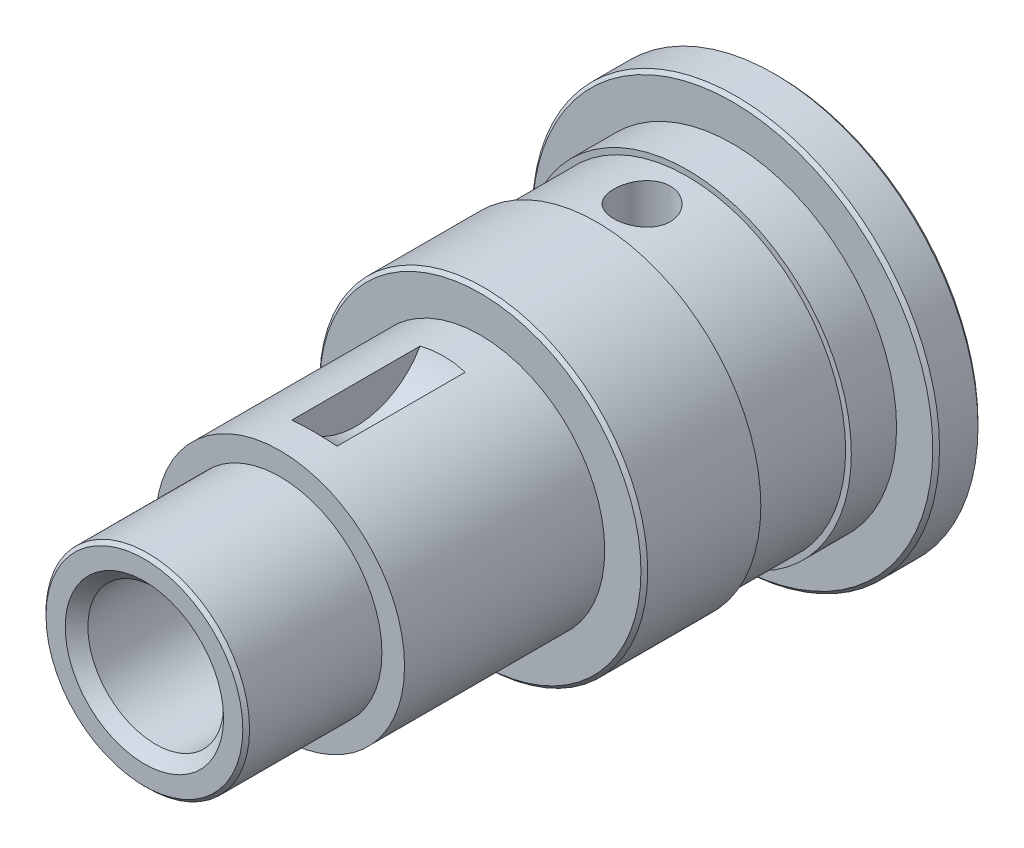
ISO-10303-21;
HEADER;
FILE_DESCRIPTION(('STEP AP214'),'2;1');
FILE_NAME('part.step','',(''),(''),'','','');
FILE_SCHEMA(('AUTOMOTIVE_DESIGN { 1 0 10303 214 1 1 1 1 }'));
ENDSEC;
DATA;
#1=APPLICATION_CONTEXT('core data for automotive mechanical design processes');
#2=APPLICATION_PROTOCOL_DEFINITION('international standard','automotive_design',2000,#1);
#3=PRODUCT_CONTEXT('',#1,'mechanical');
#4=PRODUCT('Part','Part','',(#3));
#5=PRODUCT_RELATED_PRODUCT_CATEGORY('part','',(#4));
#6=PRODUCT_DEFINITION_FORMATION('','',#4);
#7=PRODUCT_DEFINITION_CONTEXT('part definition',#1,'design');
#8=PRODUCT_DEFINITION('design','',#6,#7);
#9=PRODUCT_DEFINITION_SHAPE('','',#8);
#10=(LENGTH_UNIT() NAMED_UNIT(*) SI_UNIT(.MILLI.,.METRE.));
#11=(NAMED_UNIT(*) PLANE_ANGLE_UNIT() SI_UNIT($,.RADIAN.));
#12=(NAMED_UNIT(*) SI_UNIT($,.STERADIAN.) SOLID_ANGLE_UNIT());
#13=UNCERTAINTY_MEASURE_WITH_UNIT(LENGTH_MEASURE(1.E-05),#10,'distance_accuracy_value','');
#14=(GEOMETRIC_REPRESENTATION_CONTEXT(3) GLOBAL_UNCERTAINTY_ASSIGNED_CONTEXT((#13)) GLOBAL_UNIT_ASSIGNED_CONTEXT((#10,
#11,#12)) REPRESENTATION_CONTEXT('',''));
#15=CARTESIAN_POINT('',(0.,0.,0.));
#16=DIRECTION('',(0.,0.,1.));
#17=DIRECTION('',(1.,0.,0.));
#18=AXIS2_PLACEMENT_3D('',#15,#16,#17);
#19=CARTESIAN_POINT('',(0.,0.,56.));
#20=DIRECTION('',(0.,0.,1.));
#21=DIRECTION('',(1.,0.,0.));
#22=AXIS2_PLACEMENT_3D('',#19,#20,#21);
#23=CYLINDRICAL_SURFACE('',#22,5.99999999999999);
#24=CARTESIAN_POINT('',(0.,0.,1.));
#25=DIRECTION('',(0.,0.,1.));
#26=DIRECTION('',(1.,0.,0.));
#27=AXIS2_PLACEMENT_3D('',#24,#25,#26);
#28=CIRCLE('',#27,5.99999999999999);
#29=CARTESIAN_POINT('',(5.99999999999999,0.,1.));
#30=VERTEX_POINT('',#29);
#31=EDGE_CURVE('E185',#30,#30,#28,.T.);
#32=ORIENTED_EDGE('',*,*,#31,.F.);
#33=EDGE_LOOP('',(#32));
#34=FACE_BOUND('',#33,.T.);
#35=CARTESIAN_POINT('',(0.,0.,7.00000000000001));
#36=DIRECTION('',(0.,0.,1.));
#37=DIRECTION('',(1.,0.,0.));
#38=AXIS2_PLACEMENT_3D('',#35,#36,#37);
#39=CIRCLE('',#38,5.99999999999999);
#40=CARTESIAN_POINT('',(5.99999999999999,0.,7.00000000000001));
#41=VERTEX_POINT('',#40);
#42=EDGE_CURVE('E32',#41,#41,#39,.F.);
#43=ORIENTED_EDGE('',*,*,#42,.F.);
#44=EDGE_LOOP('',(#43));
#45=FACE_BOUND('',#44,.T.);
#46=ADVANCED_FACE('F28',(#34,#45),#23,.F.);
#47=CARTESIAN_POINT('',(0.,0.,27.));
#48=DIRECTION('',(0.,0.,1.));
#49=DIRECTION('',(1.,0.,0.));
#50=AXIS2_PLACEMENT_3D('',#47,#48,#49);
#51=CIRCLE('',#50,5.99999999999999);
#52=CARTESIAN_POINT('',(5.99999999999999,0.,27.));
#53=VERTEX_POINT('',#52);
#54=EDGE_CURVE('E219',#53,#53,#51,.F.);
#55=ORIENTED_EDGE('',*,*,#54,.T.);
#56=EDGE_LOOP('',(#55));
#57=FACE_BOUND('',#56,.T.);
#58=CARTESIAN_POINT('',(0.,0.,55.));
#59=DIRECTION('',(0.,0.,1.));
#60=DIRECTION('',(1.,0.,0.));
#61=AXIS2_PLACEMENT_3D('',#58,#59,#60);
#62=CIRCLE('',#61,5.99999999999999);
#63=CARTESIAN_POINT('',(5.99999999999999,0.,55.));
#64=VERTEX_POINT('',#63);
#65=EDGE_CURVE('E183',#64,#64,#62,.T.);
#66=ORIENTED_EDGE('',*,*,#65,.T.);
#67=EDGE_LOOP('',(#66));
#68=FACE_BOUND('',#67,.T.);
#69=ADVANCED_FACE('F110',(#57,#68),#23,.F.);
#70=CARTESIAN_POINT('',(0.,0.,8.));
#71=DIRECTION('',(0.,0.,1.));
#72=DIRECTION('',(1.,0.,0.));
#73=AXIS2_PLACEMENT_3D('',#70,#71,#72);
#74=CYLINDRICAL_SURFACE('',#73,14.);
#75=CARTESIAN_POINT('',(0.,0.,16.));
#76=DIRECTION('',(0.,0.,1.));
#77=DIRECTION('',(1.,0.,0.));
#78=AXIS2_PLACEMENT_3D('',#75,#76,#77);
#79=CIRCLE('',#78,14.);
#80=CARTESIAN_POINT('',(14.,0.,16.));
#81=VERTEX_POINT('',#80);
#82=EDGE_CURVE('E198',#81,#81,#79,.T.);
#83=ORIENTED_EDGE('',*,*,#82,.F.);
#84=EDGE_LOOP('',(#83));
#85=FACE_BOUND('',#84,.T.);
#86=CARTESIAN_POINT('',(0.,0.,8.));
#87=DIRECTION('',(0.,0.,1.));
#88=DIRECTION('',(1.,0.,0.));
#89=AXIS2_PLACEMENT_3D('',#86,#87,#88);
#90=CIRCLE('',#89,14.);
#91=CARTESIAN_POINT('',(14.,0.,8.));
#92=VERTEX_POINT('',#91);
#93=EDGE_CURVE('E194',#92,#92,#90,.T.);
#94=ORIENTED_EDGE('',*,*,#93,.T.);
#95=EDGE_LOOP('',(#94));
#96=FACE_BOUND('',#95,.T.);
#97=CARTESIAN_POINT('',(0.,14.,9.5));
#98=CARTESIAN_POINT('',(0.139239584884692,13.9999975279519,9.50000544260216));
#99=CARTESIAN_POINT('',(0.278551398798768,13.9979012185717,9.51167190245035));
#100=CARTESIAN_POINT('',(0.55325746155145,13.9897405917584,9.5580041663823));
#101=CARTESIAN_POINT('',(0.688648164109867,13.9836727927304,9.59269015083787));
#102=CARTESIAN_POINT('',(0.951498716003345,13.9682487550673,9.68397223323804));
#103=CARTESIAN_POINT('',(1.07896532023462,13.9588953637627,9.74054936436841));
#104=CARTESIAN_POINT('',(1.32258294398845,13.9379246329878,9.87395568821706));
#105=CARTESIAN_POINT('',(1.43873504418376,13.9263075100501,9.95078294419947));
#106=CARTESIAN_POINT('',(1.65770744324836,13.9019523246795,10.1233992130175));
#107=CARTESIAN_POINT('',(1.76038642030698,13.8892044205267,10.2193661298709));
#108=CARTESIAN_POINT('',(1.94827611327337,13.8640984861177,10.4271547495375));
#109=CARTESIAN_POINT('',(2.03348564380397,13.851740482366,10.5389775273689));
#110=CARTESIAN_POINT('',(2.18459604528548,13.828718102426,10.7762901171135));
#111=CARTESIAN_POINT('',(2.25035491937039,13.8180664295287,10.901871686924));
#112=CARTESIAN_POINT('',(2.35978878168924,13.799800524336,11.1625211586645));
#113=CARTESIAN_POINT('',(2.40346549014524,13.7921860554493,11.2975883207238));
#114=CARTESIAN_POINT('',(2.46704527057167,13.7809553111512,11.5718688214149));
#115=CARTESIAN_POINT('',(2.48719373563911,13.7772977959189,11.7110235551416));
#116=CARTESIAN_POINT('',(2.50390640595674,13.7742705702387,11.9907829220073));
#117=CARTESIAN_POINT('',(2.5004725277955,13.7749005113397,12.1313874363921));
#118=CARTESIAN_POINT('',(2.47031736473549,13.78033942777,12.4082888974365));
#119=CARTESIAN_POINT('',(2.44387361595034,13.7850985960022,12.5446171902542));
#120=CARTESIAN_POINT('',(2.3688857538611,13.7981816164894,12.8108706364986));
#121=CARTESIAN_POINT('',(2.3203407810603,13.8065056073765,12.9407955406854));
#122=CARTESIAN_POINT('',(2.2022526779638,13.8258332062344,13.1913744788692));
#123=CARTESIAN_POINT('',(2.13259607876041,13.836851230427,13.3119738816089));
#124=CARTESIAN_POINT('',(1.97434240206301,13.8603157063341,13.5398775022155));
#125=CARTESIAN_POINT('',(1.88574357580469,13.8727622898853,13.6471804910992));
#126=CARTESIAN_POINT('',(1.69061708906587,13.8978993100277,13.8470502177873));
#127=CARTESIAN_POINT('',(1.58385171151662,13.9105906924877,13.9393849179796));
#128=CARTESIAN_POINT('',(1.35622200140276,13.934623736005,14.104866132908));
#129=CARTESIAN_POINT('',(1.23535755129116,13.9459653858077,14.1780124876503));
#130=CARTESIAN_POINT('',(0.98272912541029,13.9660408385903,14.3030690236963));
#131=CARTESIAN_POINT('',(0.850953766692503,13.9747718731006,14.3549566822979));
#132=CARTESIAN_POINT('',(0.58036740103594,13.9886206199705,14.435796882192));
#133=CARTESIAN_POINT('',(0.44155707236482,13.9937386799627,14.4647516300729));
#134=CARTESIAN_POINT('',(0.162838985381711,13.999737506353,14.498584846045));
#135=CARTESIAN_POINT('',(0.022971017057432,14.0006742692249,14.503781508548));
#136=CARTESIAN_POINT('',(-0.255635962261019,13.9983590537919,14.4908022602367));
#137=CARTESIAN_POINT('',(-0.39437502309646,13.9951072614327,14.4726273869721));
#138=CARTESIAN_POINT('',(-0.665788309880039,13.9848150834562,14.4136856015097));
#139=CARTESIAN_POINT('',(-0.798498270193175,13.9778014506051,14.3730781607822));
#140=CARTESIAN_POINT('',(-1.0552266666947,13.960768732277,14.2705953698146));
#141=CARTESIAN_POINT('',(-1.17924455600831,13.9507494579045,14.2087186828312));
#142=CARTESIAN_POINT('',(-1.4164370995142,13.9286773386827,14.0647387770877));
#143=CARTESIAN_POINT('',(-1.52949072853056,13.9166051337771,13.9824392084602));
#144=CARTESIAN_POINT('',(-1.74029662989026,13.8918196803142,13.8002173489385));
#145=CARTESIAN_POINT('',(-1.8380476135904,13.8791063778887,13.7002935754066));
#146=CARTESIAN_POINT('',(-2.01666949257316,13.8542878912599,13.4842250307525));
#147=CARTESIAN_POINT('',(-2.09732417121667,13.8421918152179,13.3679002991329));
#148=CARTESIAN_POINT('',(-2.23794827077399,13.8201546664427,13.1231663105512));
#149=CARTESIAN_POINT('',(-2.29791841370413,13.8102135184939,12.9947574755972));
#150=CARTESIAN_POINT('',(-2.39515706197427,13.7936819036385,12.7300738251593));
#151=CARTESIAN_POINT('',(-2.43252842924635,13.7870762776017,12.5938377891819));
#152=CARTESIAN_POINT('',(-2.48382895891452,13.7779274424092,12.3168927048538));
#153=CARTESIAN_POINT('',(-2.49776049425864,13.7753838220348,12.1761841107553));
#154=CARTESIAN_POINT('',(-2.50171229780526,13.7746664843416,11.8964507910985));
#155=CARTESIAN_POINT('',(-2.49207328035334,13.7764304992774,11.7574309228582));
#156=CARTESIAN_POINT('',(-2.44989946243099,13.7839923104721,11.4830261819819));
#157=CARTESIAN_POINT('',(-2.41736476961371,13.7897900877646,11.3476412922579));
#158=CARTESIAN_POINT('',(-2.3304611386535,13.8047410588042,11.0845101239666));
#159=CARTESIAN_POINT('',(-2.27612576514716,13.8138890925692,10.9567524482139));
#160=CARTESIAN_POINT('',(-2.14719934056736,13.8345140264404,10.7121115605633));
#161=CARTESIAN_POINT('',(-2.07260704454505,13.8459910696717,10.5952290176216));
#162=CARTESIAN_POINT('',(-1.90408567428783,13.8701759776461,10.37394295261));
#163=CARTESIAN_POINT('',(-1.80990741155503,13.882898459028,10.2697307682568));
#164=CARTESIAN_POINT('',(-1.60540999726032,13.9080282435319,10.0784741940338));
#165=CARTESIAN_POINT('',(-1.49508713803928,13.920435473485,9.99143375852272));
#166=CARTESIAN_POINT('',(-1.26037074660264,13.9436534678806,9.83634223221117));
#167=CARTESIAN_POINT('',(-1.13587103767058,13.9544505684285,9.76844974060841));
#168=CARTESIAN_POINT('',(-0.87708484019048,13.9730987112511,9.65465079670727));
#169=CARTESIAN_POINT('',(-0.742807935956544,13.9809525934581,9.60872313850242));
#170=CARTESIAN_POINT('',(-0.50673175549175,13.9911779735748,9.54976938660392));
#171=CARTESIAN_POINT('',(-0.406334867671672,13.9944679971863,9.53113686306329));
#172=CARTESIAN_POINT('',(-0.203971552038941,13.9988798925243,9.50625030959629));
#173=CARTESIAN_POINT('',(-0.102005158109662,14.0000018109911,9.49999601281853));
#174=CARTESIAN_POINT('',(0.,14.,9.5));
#175=B_SPLINE_CURVE_WITH_KNOTS('',3,(#97,#98,#99,#100,#101,#102,#103,#104,#105,#106,#107,#108,
#109,#110,#111,#112,#113,#114,#115,#116,#117,#118,#119,#120,#121,#122,#123,#124,#125,#126,#127,
#128,#129,#130,#131,#132,#133,#134,#135,#136,#137,#138,#139,#140,#141,#142,#143,#144,#145,#146,
#147,#148,#149,#150,#151,#152,#153,#154,#155,#156,#157,#158,#159,#160,#161,#162,#163,#164,#165,
#166,#167,#168,#169,#170,#171,#172,#173,#174),.UNSPECIFIED.,.T.,.F.,(4,2,2,2,2,2,2,2,2,2,2,2,2,
2,2,2,2,2,2,2,2,2,2,2,2,2,2,2,2,2,2,2,2,2,2,2,2,2,4),(0.,0.41734579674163,0.835057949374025,
1.25240899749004,1.66972014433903,2.09110796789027,2.5125243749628,2.93694536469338,
3.36133328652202,3.78125426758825,4.20114112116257,4.61603258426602,5.03094018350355,
5.44811857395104,5.86533549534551,6.28850377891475,6.71167559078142,7.13529458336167,
7.55887281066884,7.97676106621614,8.39463077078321,8.80956740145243,9.22453011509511,
9.64364840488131,10.062801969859,10.4869762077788,10.9111356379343,11.3333496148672,
11.7555208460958,12.1716257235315,12.5877286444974,13.0031933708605,13.4186836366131,
13.8398246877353,14.2610626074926,14.6856934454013,15.109913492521,15.4156623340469,
15.7214045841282),.UNSPECIFIED.);
#176=CARTESIAN_POINT('',(0.,14.,9.5));
#177=VERTEX_POINT('',#176);
#178=EDGE_CURVE('E201',#177,#177,#175,.T.);
#179=ORIENTED_EDGE('',*,*,#178,.T.);
#180=EDGE_LOOP('',(#179));
#181=FACE_BOUND('',#180,.T.);
#182=ADVANCED_FACE('F116',(#85,#96,#181),#74,.T.);
#183=CARTESIAN_POINT('',(0.,0.,-41.0121933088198));
#184=DIRECTION('',(0.,0.,1.));
#185=DIRECTION('',(1.,0.,0.));
#186=AXIS2_PLACEMENT_3D('',#183,#184,#185);
#187=CYLINDRICAL_SURFACE('',#186,14.5);
#188=CARTESIAN_POINT('',(0.,0.,4.));
#189=DIRECTION('',(0.,0.,1.));
#190=DIRECTION('',(1.,0.,0.));
#191=AXIS2_PLACEMENT_3D('',#188,#189,#190);
#192=CIRCLE('',#191,14.5);
#193=CARTESIAN_POINT('',(14.5,0.,4.));
#194=VERTEX_POINT('',#193);
#195=EDGE_CURVE('E62',#194,#194,#192,.F.);
#196=ORIENTED_EDGE('',*,*,#195,.F.);
#197=EDGE_LOOP('',(#196));
#198=FACE_BOUND('',#197,.T.);
#199=CARTESIAN_POINT('',(0.,0.,8.));
#200=DIRECTION('',(0.,0.,1.));
#201=DIRECTION('',(1.,0.,0.));
#202=AXIS2_PLACEMENT_3D('',#199,#200,#201);
#203=CIRCLE('',#202,14.5);
#204=CARTESIAN_POINT('',(14.5,0.,8.));
#205=VERTEX_POINT('',#204);
#206=EDGE_CURVE('E193',#205,#205,#203,.F.);
#207=ORIENTED_EDGE('',*,*,#206,.T.);
#208=EDGE_LOOP('',(#207));
#209=FACE_BOUND('',#208,.T.);
#210=ADVANCED_FACE('F150',(#198,#209),#187,.T.);
#211=CARTESIAN_POINT('',(0.,0.,26.3));
#212=DIRECTION('',(0.,0.,1.));
#213=DIRECTION('',(1.,0.,0.));
#214=AXIS2_PLACEMENT_3D('',#211,#212,#213);
#215=CYLINDRICAL_SURFACE('',#214,11.);
#216=CARTESIAN_POINT('',(0.,0.,44.));
#217=DIRECTION('',(0.,0.,1.));
#218=DIRECTION('',(1.,0.,0.));
#219=AXIS2_PLACEMENT_3D('',#216,#217,#218);
#220=CIRCLE('',#219,11.);
#221=CARTESIAN_POINT('',(11.,0.,44.));
#222=VERTEX_POINT('',#221);
#223=EDGE_CURVE('E137',#222,#222,#220,.F.);
#224=ORIENTED_EDGE('',*,*,#223,.T.);
#225=EDGE_LOOP('',(#224));
#226=FACE_BOUND('',#225,.T.);
#227=CARTESIAN_POINT('',(0.,0.,26.3));
#228=DIRECTION('',(0.,0.,1.));
#229=DIRECTION('',(1.,0.,0.));
#230=AXIS2_PLACEMENT_3D('',#227,#228,#229);
#231=CIRCLE('',#230,11.);
#232=CARTESIAN_POINT('',(11.,0.,26.3));
#233=VERTEX_POINT('',#232);
#234=EDGE_CURVE('E141',#233,#233,#231,.T.);
#235=ORIENTED_EDGE('',*,*,#234,.T.);
#236=EDGE_LOOP('',(#235));
#237=FACE_BOUND('',#236,.T.);
#238=CARTESIAN_POINT('',(-2.,10.816653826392,40.9671251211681));
#239=CARTESIAN_POINT('',(-1.86372831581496,10.8418538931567,40.9812701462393));
#240=CARTESIAN_POINT('',(-1.72682002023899,10.864501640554,40.9937809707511));
#241=CARTESIAN_POINT('',(-1.4520052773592,10.9046294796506,41.0157007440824));
#242=CARTESIAN_POINT('',(-1.31409886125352,10.9221097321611,41.0251097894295));
#243=CARTESIAN_POINT('',(-1.03746686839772,10.9518505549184,41.0409984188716));
#244=CARTESIAN_POINT('',(-0.898740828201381,10.964107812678,41.0474761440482));
#245=CARTESIAN_POINT('',(-0.620829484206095,10.9833500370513,41.0575981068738));
#246=CARTESIAN_POINT('',(-0.481644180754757,10.9903350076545,41.0612423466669));
#247=CARTESIAN_POINT('',(-0.0686597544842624,11.003191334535,41.0679531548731));
#248=CARTESIAN_POINT('',(0.205484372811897,11.001489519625,41.0670718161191));
#249=CARTESIAN_POINT('',(0.752450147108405,10.9776451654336,41.0546112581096));
#250=CARTESIAN_POINT('',(1.02527260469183,10.9555173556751,41.0430397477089));
#251=CARTESIAN_POINT('',(1.41420975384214,10.9093577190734,41.0182307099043));
#252=CARTESIAN_POINT('',(1.5316443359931,10.8934881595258,41.0096408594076));
#253=CARTESIAN_POINT('',(1.76620625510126,10.8579297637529,40.9901495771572));
#254=CARTESIAN_POINT('',(1.88333066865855,10.8382264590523,40.9792393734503));
#255=CARTESIAN_POINT('',(2.,10.816653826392,40.9671251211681));
#256=B_SPLINE_CURVE_WITH_KNOTS('',3,(#238,#239,#240,#241,#242,#243,#244,#245,#246,#247,#248,
#249,#250,#251,#252,#253,#254,#255),.UNSPECIFIED.,.F.,.F.,(4,2,2,2,2,2,2,2,4),(0.,
0.417864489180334,0.835715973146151,1.25383207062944,1.67194785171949,2.49337212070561,
3.31420450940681,3.67057317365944,4.02831380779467),.UNSPECIFIED.);
#257=CARTESIAN_POINT('',(-2.,10.816653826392,40.9671251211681));
#258=VERTEX_POINT('',#257);
#259=CARTESIAN_POINT('',(2.,10.816653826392,40.9671251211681));
#260=VERTEX_POINT('',#259);
#261=EDGE_CURVE('E65',#258,#260,#256,.T.);
#262=ORIENTED_EDGE('',*,*,#261,.F.);
#263=DIRECTION('',(0.,0.,1.));
#264=VECTOR('',#263,1.);
#265=CARTESIAN_POINT('',(-2.,10.816653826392,26.3));
#266=LINE('',#265,#264);
#267=CARTESIAN_POINT('',(-2.,10.816653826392,29.6328748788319));
#268=VERTEX_POINT('',#267);
#269=EDGE_CURVE('E71',#258,#268,#266,.F.);
#270=ORIENTED_EDGE('',*,*,#269,.T.);
#271=CARTESIAN_POINT('',(2.,10.816653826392,29.6328748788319));
#272=CARTESIAN_POINT('',(1.86372831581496,10.8418538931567,29.6187298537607));
#273=CARTESIAN_POINT('',(1.72682002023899,10.864501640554,29.6062190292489));
#274=CARTESIAN_POINT('',(1.4520052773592,10.9046294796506,29.5842992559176));
#275=CARTESIAN_POINT('',(1.31409886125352,10.9221097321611,29.5748902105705));
#276=CARTESIAN_POINT('',(1.03746686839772,10.9518505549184,29.5590015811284));
#277=CARTESIAN_POINT('',(0.898740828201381,10.964107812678,29.5525238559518));
#278=CARTESIAN_POINT('',(0.620829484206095,10.9833500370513,29.5424018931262));
#279=CARTESIAN_POINT('',(0.481644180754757,10.9903350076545,29.5387576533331));
#280=CARTESIAN_POINT('',(0.0686597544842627,11.003191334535,29.5320468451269));
#281=CARTESIAN_POINT('',(-0.205484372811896,11.001489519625,29.5329281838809));
#282=CARTESIAN_POINT('',(-0.752450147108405,10.9776451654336,29.5453887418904));
#283=CARTESIAN_POINT('',(-1.02527260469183,10.9555173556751,29.5569602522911));
#284=CARTESIAN_POINT('',(-1.41420975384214,10.9093577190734,29.5817692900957));
#285=CARTESIAN_POINT('',(-1.5316443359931,10.8934881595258,29.5903591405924));
#286=CARTESIAN_POINT('',(-1.76620625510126,10.8579297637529,29.6098504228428));
#287=CARTESIAN_POINT('',(-1.88333066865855,10.8382264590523,29.6207606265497));
#288=CARTESIAN_POINT('',(-2.,10.816653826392,29.6328748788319));
#289=B_SPLINE_CURVE_WITH_KNOTS('',3,(#271,#272,#273,#274,#275,#276,#277,#278,#279,#280,#281,
#282,#283,#284,#285,#286,#287,#288),.UNSPECIFIED.,.F.,.F.,(4,2,2,2,2,2,2,2,4),(0.,
0.417864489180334,0.835715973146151,1.25383207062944,1.67194785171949,2.49337212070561,
3.31420450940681,3.67057317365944,4.02831380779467),.UNSPECIFIED.);
#290=CARTESIAN_POINT('',(2.,10.816653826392,29.6328748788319));
#291=VERTEX_POINT('',#290);
#292=EDGE_CURVE('E51',#291,#268,#289,.T.);
#293=ORIENTED_EDGE('',*,*,#292,.F.);
#294=DIRECTION('',(0.,0.,1.));
#295=VECTOR('',#294,1.);
#296=CARTESIAN_POINT('',(2.,10.816653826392,26.3));
#297=LINE('',#296,#295);
#298=EDGE_CURVE('E58',#260,#291,#297,.F.);
#299=ORIENTED_EDGE('',*,*,#298,.F.);
#300=EDGE_LOOP('',(#262,#270,#293,#299));
#301=FACE_BOUND('',#300,.T.);
#302=ADVANCED_FACE('F70',(#226,#237,#301),#215,.T.);
#303=CARTESIAN_POINT('',(0.,0.,16.));
#304=DIRECTION('',(0.,0.,1.));
#305=DIRECTION('',(1.,0.,0.));
#306=AXIS2_PLACEMENT_3D('',#303,#304,#305);
#307=CIRCLE('',#306,14.5);
#308=CARTESIAN_POINT('',(14.5,0.,16.));
#309=VERTEX_POINT('',#308);
#310=EDGE_CURVE('E197',#309,#309,#307,.F.);
#311=ORIENTED_EDGE('',*,*,#310,.F.);
#312=EDGE_LOOP('',(#311));
#313=FACE_BOUND('',#312,.T.);
#314=CARTESIAN_POINT('',(0.,0.,26.));
#315=DIRECTION('',(0.,0.,1.));
#316=DIRECTION('',(1.,0.,0.));
#317=AXIS2_PLACEMENT_3D('',#314,#315,#316);
#318=CIRCLE('',#317,14.5);
#319=CARTESIAN_POINT('',(14.5,0.,26.));
#320=VERTEX_POINT('',#319);
#321=EDGE_CURVE('E37',#320,#320,#318,.F.);
#322=ORIENTED_EDGE('',*,*,#321,.T.);
#323=EDGE_LOOP('',(#322));
#324=FACE_BOUND('',#323,.T.);
#325=ADVANCED_FACE('F149',(#313,#324),#187,.T.);
#326=CARTESIAN_POINT('',(0.,0.,56.));
#327=DIRECTION('',(0.,0.,-1.));
#328=DIRECTION('',(-1.,0.,0.));
#329=AXIS2_PLACEMENT_3D('',#326,#327,#328);
#330=CYLINDRICAL_SURFACE('',#329,18.);
#331=CARTESIAN_POINT('',(0.,0.,3.69999999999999));
#332=DIRECTION('',(0.,0.,1.));
#333=DIRECTION('',(1.,0.,0.));
#334=AXIS2_PLACEMENT_3D('',#331,#332,#333);
#335=CIRCLE('',#334,18.);
#336=CARTESIAN_POINT('',(18.,0.,3.69999999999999));
#337=VERTEX_POINT('',#336);
#338=EDGE_CURVE('E289',#337,#337,#335,.F.);
#339=ORIENTED_EDGE('',*,*,#338,.T.);
#340=EDGE_LOOP('',(#339));
#341=FACE_BOUND('',#340,.T.);
#342=CARTESIAN_POINT('',(0.,0.,0.300000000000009));
#343=DIRECTION('',(0.,0.,1.));
#344=DIRECTION('',(1.,0.,0.));
#345=AXIS2_PLACEMENT_3D('',#342,#343,#344);
#346=CIRCLE('',#345,18.);
#347=CARTESIAN_POINT('',(18.,0.,0.300000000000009));
#348=VERTEX_POINT('',#347);
#349=EDGE_CURVE('E294',#348,#348,#346,.T.);
#350=ORIENTED_EDGE('',*,*,#349,.T.);
#351=EDGE_LOOP('',(#350));
#352=FACE_BOUND('',#351,.T.);
#353=ADVANCED_FACE('F30',(#341,#352),#330,.T.);
#354=CARTESIAN_POINT('',(0.,0.,0.));
#355=DIRECTION('',(0.,0.,1.));
#356=DIRECTION('',(1.,0.,0.));
#357=AXIS2_PLACEMENT_3D('',#354,#355,#356);
#358=PLANE('',#357);
#359=CARTESIAN_POINT('',(0.,0.,0.));
#360=DIRECTION('',(0.,0.,1.));
#361=DIRECTION('',(1.,0.,0.));
#362=AXIS2_PLACEMENT_3D('',#359,#360,#361);
#363=CIRCLE('',#362,17.7);
#364=CARTESIAN_POINT('',(17.7,0.,0.));
#365=VERTEX_POINT('',#364);
#366=EDGE_CURVE('E300',#365,#365,#363,.F.);
#367=ORIENTED_EDGE('',*,*,#366,.T.);
#368=EDGE_LOOP('',(#367));
#369=FACE_BOUND('',#368,.T.);
#370=CARTESIAN_POINT('',(0.,0.,0.));
#371=DIRECTION('',(0.,0.,1.));
#372=DIRECTION('',(1.,0.,0.));
#373=AXIS2_PLACEMENT_3D('',#370,#371,#372);
#374=CIRCLE('',#373,6.99999999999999);
#375=CARTESIAN_POINT('',(6.99999999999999,0.,0.));
#376=VERTEX_POINT('',#375);
#377=EDGE_CURVE('E190',#376,#376,#374,.T.);
#378=ORIENTED_EDGE('',*,*,#377,.T.);
#379=EDGE_LOOP('',(#378));
#380=FACE_BOUND('',#379,.T.);
#381=ADVANCED_FACE('F169',(#369,#380),#358,.F.);
#382=CARTESIAN_POINT('',(0.,0.,4.));
#383=DIRECTION('',(0.,0.,1.));
#384=DIRECTION('',(1.,0.,0.));
#385=AXIS2_PLACEMENT_3D('',#382,#383,#384);
#386=PLANE('',#385);
#387=CARTESIAN_POINT('',(0.,0.,4.));
#388=DIRECTION('',(0.,0.,1.));
#389=DIRECTION('',(1.,0.,0.));
#390=AXIS2_PLACEMENT_3D('',#387,#388,#389);
#391=CIRCLE('',#390,17.7);
#392=CARTESIAN_POINT('',(17.7,0.,4.));
#393=VERTEX_POINT('',#392);
#394=EDGE_CURVE('E292',#393,#393,#391,.T.);
#395=ORIENTED_EDGE('',*,*,#394,.T.);
#396=EDGE_LOOP('',(#395));
#397=FACE_BOUND('',#396,.T.);
#398=ORIENTED_EDGE('',*,*,#195,.T.);
#399=EDGE_LOOP('',(#398));
#400=FACE_BOUND('',#399,.T.);
#401=ADVANCED_FACE('F105',(#397,#400),#386,.T.);
#402=CARTESIAN_POINT('',(0.,0.,26.3));
#403=DIRECTION('',(0.,0.,1.));
#404=DIRECTION('',(1.,0.,0.));
#405=AXIS2_PLACEMENT_3D('',#402,#403,#404);
#406=PLANE('',#405);
#407=CARTESIAN_POINT('',(0.,0.,26.3));
#408=DIRECTION('',(0.,0.,1.));
#409=DIRECTION('',(1.,0.,0.));
#410=AXIS2_PLACEMENT_3D('',#407,#408,#409);
#411=CIRCLE('',#410,14.2);
#412=CARTESIAN_POINT('',(14.2,0.,26.3));
#413=VERTEX_POINT('',#412);
#414=EDGE_CURVE('E11',#413,#413,#411,.T.);
#415=ORIENTED_EDGE('',*,*,#414,.T.);
#416=EDGE_LOOP('',(#415));
#417=FACE_BOUND('',#416,.T.);
#418=ORIENTED_EDGE('',*,*,#234,.F.);
#419=EDGE_LOOP('',(#418));
#420=FACE_BOUND('',#419,.T.);
#421=ADVANCED_FACE('F100',(#417,#420),#406,.T.);
#422=CARTESIAN_POINT('',(0.,0.,44.));
#423=DIRECTION('',(0.,0.,1.));
#424=DIRECTION('',(1.,0.,0.));
#425=AXIS2_PLACEMENT_3D('',#422,#423,#424);
#426=PLANE('',#425);
#427=ORIENTED_EDGE('',*,*,#223,.F.);
#428=EDGE_LOOP('',(#427));
#429=FACE_BOUND('',#428,.T.);
#430=CARTESIAN_POINT('',(0.,0.,44.));
#431=DIRECTION('',(0.,0.,1.));
#432=DIRECTION('',(1.,0.,0.));
#433=AXIS2_PLACEMENT_3D('',#430,#431,#432);
#434=CIRCLE('',#433,9.);
#435=CARTESIAN_POINT('',(9.,0.,44.));
#436=VERTEX_POINT('',#435);
#437=EDGE_CURVE('E134',#436,#436,#434,.T.);
#438=ORIENTED_EDGE('',*,*,#437,.F.);
#439=EDGE_LOOP('',(#438));
#440=FACE_BOUND('',#439,.T.);
#441=ADVANCED_FACE('F97',(#429,#440),#426,.T.);
#442=CARTESIAN_POINT('',(0.,0.,44.));
#443=DIRECTION('',(0.,0.,1.));
#444=DIRECTION('',(1.,0.,0.));
#445=AXIS2_PLACEMENT_3D('',#442,#443,#444);
#446=CYLINDRICAL_SURFACE('',#445,9.);
#447=CARTESIAN_POINT('',(0.,0.,55.7));
#448=DIRECTION('',(0.,0.,1.));
#449=DIRECTION('',(1.,0.,0.));
#450=AXIS2_PLACEMENT_3D('',#447,#448,#449);
#451=CIRCLE('',#450,9.);
#452=CARTESIAN_POINT('',(9.,0.,55.7));
#453=VERTEX_POINT('',#452);
#454=EDGE_CURVE('E304',#453,#453,#451,.F.);
#455=ORIENTED_EDGE('',*,*,#454,.T.);
#456=EDGE_LOOP('',(#455));
#457=FACE_BOUND('',#456,.T.);
#458=ORIENTED_EDGE('',*,*,#437,.T.);
#459=EDGE_LOOP('',(#458));
#460=FACE_BOUND('',#459,.T.);
#461=ADVANCED_FACE('F94',(#457,#460),#446,.T.);
#462=CARTESIAN_POINT('',(0.,0.,56.));
#463=DIRECTION('',(0.,0.,1.));
#464=DIRECTION('',(1.,0.,0.));
#465=AXIS2_PLACEMENT_3D('',#462,#463,#464);
#466=PLANE('',#465);
#467=CARTESIAN_POINT('',(0.,0.,56.));
#468=DIRECTION('',(0.,0.,1.));
#469=DIRECTION('',(1.,0.,0.));
#470=AXIS2_PLACEMENT_3D('',#467,#468,#469);
#471=CIRCLE('',#470,8.69999999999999);
#472=CARTESIAN_POINT('',(8.69999999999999,0.,56.));
#473=VERTEX_POINT('',#472);
#474=EDGE_CURVE('E179',#473,#473,#471,.T.);
#475=ORIENTED_EDGE('',*,*,#474,.T.);
#476=EDGE_LOOP('',(#475));
#477=FACE_BOUND('',#476,.T.);
#478=CARTESIAN_POINT('',(0.,0.,56.));
#479=DIRECTION('',(0.,0.,1.));
#480=DIRECTION('',(1.,0.,0.));
#481=AXIS2_PLACEMENT_3D('',#478,#479,#480);
#482=CIRCLE('',#481,7.);
#483=CARTESIAN_POINT('',(7.,0.,56.));
#484=VERTEX_POINT('',#483);
#485=EDGE_CURVE('E67',#484,#484,#482,.T.);
#486=ORIENTED_EDGE('',*,*,#485,.F.);
#487=EDGE_LOOP('',(#486));
#488=FACE_BOUND('',#487,.T.);
#489=ADVANCED_FACE('F92',(#477,#488),#466,.T.);
#490=CARTESIAN_POINT('',(-2.,14.,35.3));
#491=DIRECTION('',(1.,0.,0.));
#492=DIRECTION('',(0.,0.,-1.));
#493=AXIS2_PLACEMENT_3D('',#490,#491,#492);
#494=CYLINDRICAL_SURFACE('',#493,6.5);
#495=ORIENTED_EDGE('',*,*,#261,.T.);
#496=CARTESIAN_POINT('',(2.,14.,35.3));
#497=DIRECTION('',(1.,0.,0.));
#498=DIRECTION('',(0.,0.,-1.));
#499=AXIS2_PLACEMENT_3D('',#496,#497,#498);
#500=CIRCLE('',#499,6.5);
#501=EDGE_CURVE('E44',#260,#291,#500,.T.);
#502=ORIENTED_EDGE('',*,*,#501,.T.);
#503=ORIENTED_EDGE('',*,*,#292,.T.);
#504=CARTESIAN_POINT('',(-2.,14.,35.3));
#505=DIRECTION('',(1.,0.,0.));
#506=DIRECTION('',(0.,0.,-1.));
#507=AXIS2_PLACEMENT_3D('',#504,#505,#506);
#508=CIRCLE('',#507,6.5);
#509=EDGE_CURVE('E66',#258,#268,#508,.T.);
#510=ORIENTED_EDGE('',*,*,#509,.F.);
#511=EDGE_LOOP('',(#495,#502,#503,#510));
#512=FACE_BOUND('',#511,.T.);
#513=ADVANCED_FACE('F64',(#512),#494,.F.);
#514=CARTESIAN_POINT('',(-2.,14.,35.3));
#515=DIRECTION('',(1.,0.,0.));
#516=DIRECTION('',(0.,0.,-1.));
#517=AXIS2_PLACEMENT_3D('',#514,#515,#516);
#518=PLANE('',#517);
#519=ORIENTED_EDGE('',*,*,#509,.T.);
#520=ORIENTED_EDGE('',*,*,#269,.F.);
#521=EDGE_LOOP('',(#519,#520));
#522=FACE_BOUND('',#521,.T.);
#523=ADVANCED_FACE('F91',(#522),#518,.T.);
#524=CARTESIAN_POINT('',(2.,14.,35.3));
#525=DIRECTION('',(1.,0.,0.));
#526=DIRECTION('',(0.,0.,-1.));
#527=AXIS2_PLACEMENT_3D('',#524,#525,#526);
#528=PLANE('',#527);
#529=ORIENTED_EDGE('',*,*,#298,.T.);
#530=ORIENTED_EDGE('',*,*,#501,.F.);
#531=EDGE_LOOP('',(#529,#530));
#532=FACE_BOUND('',#531,.T.);
#533=ADVANCED_FACE('F59',(#532),#528,.F.);
#534=CARTESIAN_POINT('',(0.,0.,56.));
#535=DIRECTION('',(0.,0.,1.));
#536=DIRECTION('',(1.,0.,0.));
#537=AXIS2_PLACEMENT_3D('',#534,#535,#536);
#538=CONICAL_SURFACE('',#537,7.,0.785398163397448);
#539=ORIENTED_EDGE('',*,*,#65,.F.);
#540=EDGE_LOOP('',(#539));
#541=FACE_BOUND('',#540,.T.);
#542=ORIENTED_EDGE('',*,*,#485,.T.);
#543=EDGE_LOOP('',(#542));
#544=FACE_BOUND('',#543,.T.);
#545=ADVANCED_FACE('F124',(#541,#544),#538,.F.);
#546=CARTESIAN_POINT('',(0.,0.,1.));
#547=DIRECTION('',(0.,0.,-1.));
#548=DIRECTION('',(-1.,0.,0.));
#549=AXIS2_PLACEMENT_3D('',#546,#547,#548);
#550=CONICAL_SURFACE('',#549,5.99999999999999,0.785398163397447);
#551=ORIENTED_EDGE('',*,*,#377,.F.);
#552=EDGE_LOOP('',(#551));
#553=FACE_BOUND('',#552,.T.);
#554=ORIENTED_EDGE('',*,*,#31,.T.);
#555=EDGE_LOOP('',(#554));
#556=FACE_BOUND('',#555,.T.);
#557=ADVANCED_FACE('F122',(#553,#556),#550,.F.);
#558=CARTESIAN_POINT('',(0.,0.,4.));
#559=DIRECTION('',(0.,0.,-1.));
#560=DIRECTION('',(-1.,0.,0.));
#561=AXIS2_PLACEMENT_3D('',#558,#559,#560);
#562=CONICAL_SURFACE('',#561,17.7,0.785398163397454);
#563=ORIENTED_EDGE('',*,*,#338,.F.);
#564=EDGE_LOOP('',(#563));
#565=FACE_BOUND('',#564,.T.);
#566=ORIENTED_EDGE('',*,*,#394,.F.);
#567=EDGE_LOOP('',(#566));
#568=FACE_BOUND('',#567,.T.);
#569=ADVANCED_FACE('F278',(#565,#568),#562,.T.);
#570=CARTESIAN_POINT('',(0.,0.,0.300000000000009));
#571=DIRECTION('',(0.,0.,1.));
#572=DIRECTION('',(1.,0.,0.));
#573=AXIS2_PLACEMENT_3D('',#570,#571,#572);
#574=CONICAL_SURFACE('',#573,18.,0.785398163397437);
#575=ORIENTED_EDGE('',*,*,#366,.F.);
#576=EDGE_LOOP('',(#575));
#577=FACE_BOUND('',#576,.T.);
#578=ORIENTED_EDGE('',*,*,#349,.F.);
#579=EDGE_LOOP('',(#578));
#580=FACE_BOUND('',#579,.T.);
#581=ADVANCED_FACE('F275',(#577,#580),#574,.T.);
#582=CARTESIAN_POINT('',(0.,0.,56.));
#583=DIRECTION('',(0.,0.,-1.));
#584=DIRECTION('',(-1.,0.,0.));
#585=AXIS2_PLACEMENT_3D('',#582,#583,#584);
#586=CONICAL_SURFACE('',#585,8.69999999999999,0.785398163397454);
#587=ORIENTED_EDGE('',*,*,#454,.F.);
#588=EDGE_LOOP('',(#587));
#589=FACE_BOUND('',#588,.T.);
#590=ORIENTED_EDGE('',*,*,#474,.F.);
#591=EDGE_LOOP('',(#590));
#592=FACE_BOUND('',#591,.T.);
#593=ADVANCED_FACE('F271',(#589,#592),#586,.T.);
#594=CARTESIAN_POINT('',(0.,0.,26.));
#595=DIRECTION('',(0.,0.,-1.));
#596=DIRECTION('',(-1.,0.,0.));
#597=AXIS2_PLACEMENT_3D('',#594,#595,#596);
#598=CONICAL_SURFACE('',#597,14.5,0.785398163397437);
#599=ORIENTED_EDGE('',*,*,#414,.F.);
#600=EDGE_LOOP('',(#599));
#601=FACE_BOUND('',#600,.T.);
#602=ORIENTED_EDGE('',*,*,#321,.F.);
#603=EDGE_LOOP('',(#602));
#604=FACE_BOUND('',#603,.T.);
#605=ADVANCED_FACE('F262',(#601,#604),#598,.T.);
#606=CARTESIAN_POINT('',(0.,0.,8.));
#607=DIRECTION('',(0.,0.,1.));
#608=DIRECTION('',(1.,0.,0.));
#609=AXIS2_PLACEMENT_3D('',#606,#607,#608);
#610=PLANE('',#609);
#611=ORIENTED_EDGE('',*,*,#206,.F.);
#612=EDGE_LOOP('',(#611));
#613=FACE_BOUND('',#612,.T.);
#614=ORIENTED_EDGE('',*,*,#93,.F.);
#615=EDGE_LOOP('',(#614));
#616=FACE_BOUND('',#615,.T.);
#617=ADVANCED_FACE('F251',(#613,#616),#610,.T.);
#618=CARTESIAN_POINT('',(0.,0.,16.));
#619=DIRECTION('',(0.,0.,1.));
#620=DIRECTION('',(1.,0.,0.));
#621=AXIS2_PLACEMENT_3D('',#618,#619,#620);
#622=PLANE('',#621);
#623=ORIENTED_EDGE('',*,*,#310,.T.);
#624=EDGE_LOOP('',(#623));
#625=FACE_BOUND('',#624,.T.);
#626=ORIENTED_EDGE('',*,*,#82,.T.);
#627=EDGE_LOOP('',(#626));
#628=FACE_BOUND('',#627,.T.);
#629=ADVANCED_FACE('F242',(#625,#628),#622,.F.);
#630=CARTESIAN_POINT('',(0.,18.,12.));
#631=DIRECTION('',(0.,-1.,0.));
#632=DIRECTION('',(0.,0.,-1.));
#633=AXIS2_PLACEMENT_3D('',#630,#631,#632);
#634=CYLINDRICAL_SURFACE('',#633,2.5);
#635=CARTESIAN_POINT('',(0.,7.5,9.5));
#636=CARTESIAN_POINT('',(-0.136408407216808,7.5000003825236,9.4999993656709));
#637=CARTESIAN_POINT('',(-0.272812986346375,7.49624423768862,9.51120066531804));
#638=CARTESIAN_POINT('',(-0.54160440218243,7.48163025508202,9.55557277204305));
#639=CARTESIAN_POINT('',(-0.673990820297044,7.47077168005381,9.58874585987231));
#640=CARTESIAN_POINT('',(-0.93083197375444,7.44313269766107,9.67579810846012));
#641=CARTESIAN_POINT('',(-1.05529956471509,7.42636219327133,9.72964265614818));
#642=CARTESIAN_POINT('',(-1.29343734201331,7.38861114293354,9.85635293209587));
#643=CARTESIAN_POINT('',(-1.40710539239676,7.36762976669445,9.92922241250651));
#644=CARTESIAN_POINT('',(-1.62435418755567,7.32285236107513,10.0945645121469));
#645=CARTESIAN_POINT('',(-1.72750925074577,7.29898891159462,10.1875780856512));
#646=CARTESIAN_POINT('',(-1.91708173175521,7.25150786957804,10.3894178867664));
#647=CARTESIAN_POINT('',(-2.00349546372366,7.22789033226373,10.4982475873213));
#648=CARTESIAN_POINT('',(-2.15956235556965,7.18283331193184,10.7324627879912));
#649=CARTESIAN_POINT('',(-2.22866214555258,7.1614759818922,10.8582343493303));
#650=CARTESIAN_POINT('',(-2.3445471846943,7.12438263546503,11.1204402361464));
#651=CARTESIAN_POINT('',(-2.39133924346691,7.10864490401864,11.2568712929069));
#652=CARTESIAN_POINT('',(-2.45968365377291,7.08528258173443,11.5316830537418));
#653=CARTESIAN_POINT('',(-2.48203362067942,7.07740239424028,11.6698430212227));
#654=CARTESIAN_POINT('',(-2.50335280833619,7.06989141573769,11.9481593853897));
#655=CARTESIAN_POINT('',(-2.5023292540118,7.07025807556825,12.088315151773));
#656=CARTESIAN_POINT('',(-2.47754975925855,7.0789753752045,12.3598415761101));
#657=CARTESIAN_POINT('',(-2.45483478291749,7.08696039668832,12.4913210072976));
#658=CARTESIAN_POINT('',(-2.38901540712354,7.10941644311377,12.7484835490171));
#659=CARTESIAN_POINT('',(-2.34590856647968,7.12388824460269,12.8741659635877));
#660=CARTESIAN_POINT('',(-2.23984764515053,7.15794777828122,13.1185318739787));
#661=CARTESIAN_POINT('',(-2.17658512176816,7.17761414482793,13.2370700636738));
#662=CARTESIAN_POINT('',(-2.03222276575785,7.21981396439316,13.4621772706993));
#663=CARTESIAN_POINT('',(-1.95111778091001,7.24234824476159,13.5687428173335));
#664=CARTESIAN_POINT('',(-1.76837333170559,7.28918322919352,13.7727289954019));
#665=CARTESIAN_POINT('',(-1.66588287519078,7.31351473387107,13.8693817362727));
#666=CARTESIAN_POINT('',(-1.44584892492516,7.36017345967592,14.0443281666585));
#667=CARTESIAN_POINT('',(-1.32830398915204,7.38250048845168,14.1226200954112));
#668=CARTESIAN_POINT('',(-1.07986903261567,7.42292769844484,14.2592407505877));
#669=CARTESIAN_POINT('',(-0.948858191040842,7.44098375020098,14.3173637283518));
#670=CARTESIAN_POINT('',(-0.678172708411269,7.47051417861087,14.4105079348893));
#671=CARTESIAN_POINT('',(-0.538501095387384,7.48199084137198,14.4455371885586));
#672=CARTESIAN_POINT('',(-0.260959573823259,7.49669067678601,14.4901391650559));
#673=CARTESIAN_POINT('',(-0.123273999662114,7.5002500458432,14.5007495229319));
#674=CARTESIAN_POINT('',(0.151937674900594,7.49972256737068,14.4991683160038));
#675=CARTESIAN_POINT('',(0.289463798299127,7.49563701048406,14.4869806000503));
#676=CARTESIAN_POINT('',(0.556299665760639,7.48050061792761,14.4409702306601));
#677=CARTESIAN_POINT('',(0.685732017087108,7.46965496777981,14.4077844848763));
#678=CARTESIAN_POINT('',(0.937139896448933,7.44229617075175,14.3215163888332));
#679=CARTESIAN_POINT('',(1.05911447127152,7.42578230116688,14.2684315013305));
#680=CARTESIAN_POINT('',(1.29572074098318,7.38822328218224,14.142323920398));
#681=CARTESIAN_POINT('',(1.41007489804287,7.36707036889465,14.0688135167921));
#682=CARTESIAN_POINT('',(1.62516207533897,7.32263134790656,13.9045146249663));
#683=CARTESIAN_POINT('',(1.72589091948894,7.29934458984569,13.8137208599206));
#684=CARTESIAN_POINT('',(1.91563126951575,7.25192119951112,13.6125531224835));
#685=CARTESIAN_POINT('',(2.00390242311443,7.2277940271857,13.5014769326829));
#686=CARTESIAN_POINT('',(2.16064380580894,7.18249933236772,13.2655710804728));
#687=CARTESIAN_POINT('',(2.22911386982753,7.16133183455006,13.1407413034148));
#688=CARTESIAN_POINT('',(2.3439923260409,7.12455979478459,12.8808174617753));
#689=CARTESIAN_POINT('',(2.39044533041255,7.10894401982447,12.7457448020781));
#690=CARTESIAN_POINT('',(2.45973666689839,7.08527080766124,12.4690533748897));
#691=CARTESIAN_POINT('',(2.48258563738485,7.07720996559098,12.3274375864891));
#692=CARTESIAN_POINT('',(2.50319070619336,7.06994647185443,12.0495072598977));
#693=CARTESIAN_POINT('',(2.502175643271,7.07031000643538,11.9132941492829));
#694=CARTESIAN_POINT('',(2.47810573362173,7.07878174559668,11.6430873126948));
#695=CARTESIAN_POINT('',(2.45505219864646,7.08688948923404,11.5090934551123));
#696=CARTESIAN_POINT('',(2.38842953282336,7.10961310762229,11.2496608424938));
#697=CARTESIAN_POINT('',(2.34525836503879,7.12410245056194,11.1241079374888));
#698=CARTESIAN_POINT('',(2.23994841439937,7.15790997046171,10.8819314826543));
#699=CARTESIAN_POINT('',(2.17780542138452,7.17722921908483,10.76530992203));
#700=CARTESIAN_POINT('',(2.03315173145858,7.21957073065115,10.5387908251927));
#701=CARTESIAN_POINT('',(1.94987060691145,7.24271779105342,10.429408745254));
#702=CARTESIAN_POINT('',(1.76660720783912,7.28958390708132,10.2257754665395));
#703=CARTESIAN_POINT('',(1.6666202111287,7.31330312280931,10.1315285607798));
#704=CARTESIAN_POINT('',(1.44810389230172,7.3597507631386,9.95713896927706));
#705=CARTESIAN_POINT('',(1.32900378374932,7.38240454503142,9.8776891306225));
#706=CARTESIAN_POINT('',(1.07839339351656,7.4231497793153,9.74002392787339));
#707=CARTESIAN_POINT('',(0.946886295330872,7.44124239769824,9.6818031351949));
#708=CARTESIAN_POINT('',(0.681234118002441,7.47013787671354,9.59069591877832));
#709=CARTESIAN_POINT('',(0.547469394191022,7.48123031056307,9.55679383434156));
#710=CARTESIAN_POINT('',(0.275801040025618,7.49616017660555,9.51144929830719));
#711=CARTESIAN_POINT('',(0.137898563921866,7.49999961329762,9.50000064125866));
#712=CARTESIAN_POINT('',(0.,7.5,9.5));
#713=B_SPLINE_CURVE_WITH_KNOTS('',3,(#635,#636,#637,#638,#639,#640,#641,#642,#643,#644,#645,
#646,#647,#648,#649,#650,#651,#652,#653,#654,#655,#656,#657,#658,#659,#660,#661,#662,#663,#664,
#665,#666,#667,#668,#669,#670,#671,#672,#673,#674,#675,#676,#677,#678,#679,#680,#681,#682,#683,
#684,#685,#686,#687,#688,#689,#690,#691,#692,#693,#694,#695,#696,#697,#698,#699,#700,#701,#702,
#703,#704,#705,#706,#707,#708,#709,#710,#711,#712),.UNSPECIFIED.,.T.,.F.,(4,2,2,2,2,2,2,2,2,2,2,
2,2,2,2,2,2,2,2,2,2,2,2,2,2,2,2,2,2,2,2,2,2,2,2,2,2,2,4),(0.,0.408717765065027,
0.817477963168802,1.22555668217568,1.63371594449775,2.0546171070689,2.47561083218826,
2.90870962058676,3.34167611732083,3.760048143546,4.17829084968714,4.577420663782,
4.97659827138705,5.38220427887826,5.78792756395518,6.21483264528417,6.64177864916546,
7.07296014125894,7.50399172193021,7.91633957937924,8.32861782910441,8.72895394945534,
9.1293411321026,9.54025999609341,9.95130452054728,10.3810255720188,10.8107502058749,
11.2396003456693,11.668257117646,12.0748916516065,12.4815019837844,12.8803896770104,
13.2793659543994,13.6957516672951,14.1122552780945,14.5449915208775,14.9776170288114,
15.3909139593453,15.8040966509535),.UNSPECIFIED.);
#714=CARTESIAN_POINT('',(0.,7.5,9.5));
#715=VERTEX_POINT('',#714);
#716=EDGE_CURVE('E205',#715,#715,#713,.T.);
#717=ORIENTED_EDGE('',*,*,#716,.F.);
#718=EDGE_LOOP('',(#717));
#719=FACE_BOUND('',#718,.T.);
#720=ORIENTED_EDGE('',*,*,#178,.F.);
#721=EDGE_LOOP('',(#720));
#722=FACE_BOUND('',#721,.T.);
#723=ADVANCED_FACE('F231',(#719,#722),#634,.F.);
#724=CARTESIAN_POINT('',(0.,0.,7.));
#725=DIRECTION('',(0.,0.,1.));
#726=DIRECTION('',(1.,0.,0.));
#727=AXIS2_PLACEMENT_3D('',#724,#725,#726);
#728=PLANE('',#727);
#729=CARTESIAN_POINT('',(0.,0.,7.));
#730=DIRECTION('',(0.,0.,1.));
#731=DIRECTION('',(1.,0.,0.));
#732=AXIS2_PLACEMENT_3D('',#729,#730,#731);
#733=CIRCLE('',#732,7.5);
#734=CARTESIAN_POINT('',(7.5,0.,7.));
#735=VERTEX_POINT('',#734);
#736=EDGE_CURVE('E202',#735,#735,#733,.T.);
#737=ORIENTED_EDGE('',*,*,#736,.T.);
#738=EDGE_LOOP('',(#737));
#739=FACE_BOUND('',#738,.T.);
#740=ORIENTED_EDGE('',*,*,#42,.T.);
#741=EDGE_LOOP('',(#740));
#742=FACE_BOUND('',#741,.T.);
#743=ADVANCED_FACE('F215',(#739,#742),#728,.T.);
#744=CARTESIAN_POINT('',(0.,0.,27.));
#745=DIRECTION('',(0.,0.,1.));
#746=DIRECTION('',(1.,0.,0.));
#747=AXIS2_PLACEMENT_3D('',#744,#745,#746);
#748=PLANE('',#747);
#749=CARTESIAN_POINT('',(0.,0.,27.));
#750=DIRECTION('',(0.,0.,1.));
#751=DIRECTION('',(1.,0.,0.));
#752=AXIS2_PLACEMENT_3D('',#749,#750,#751);
#753=CIRCLE('',#752,7.5);
#754=CARTESIAN_POINT('',(7.5,0.,27.));
#755=VERTEX_POINT('',#754);
#756=EDGE_CURVE('E206',#755,#755,#753,.T.);
#757=ORIENTED_EDGE('',*,*,#756,.F.);
#758=EDGE_LOOP('',(#757));
#759=FACE_BOUND('',#758,.T.);
#760=ORIENTED_EDGE('',*,*,#54,.F.);
#761=EDGE_LOOP('',(#760));
#762=FACE_BOUND('',#761,.T.);
#763=ADVANCED_FACE('F212',(#759,#762),#748,.F.);
#764=CARTESIAN_POINT('',(0.,0.,7.));
#765=DIRECTION('',(0.,0.,1.));
#766=DIRECTION('',(1.,0.,0.));
#767=AXIS2_PLACEMENT_3D('',#764,#765,#766);
#768=CYLINDRICAL_SURFACE('',#767,7.5);
#769=ORIENTED_EDGE('',*,*,#716,.T.);
#770=EDGE_LOOP('',(#769));
#771=FACE_BOUND('',#770,.T.);
#772=ORIENTED_EDGE('',*,*,#736,.F.);
#773=EDGE_LOOP('',(#772));
#774=FACE_BOUND('',#773,.T.);
#775=ORIENTED_EDGE('',*,*,#756,.T.);
#776=EDGE_LOOP('',(#775));
#777=FACE_BOUND('',#776,.T.);
#778=ADVANCED_FACE('F210',(#771,#774,#777),#768,.F.);
#779=CLOSED_SHELL('',(#46,#69,#182,#210,#302,#325,#353,#381,#401,#421,#441,#461,#489,#513,#523,
#533,#545,#557,#569,#581,#593,#605,#617,#629,#723,#743,#763,#778));
#780=MANIFOLD_SOLID_BREP('B2',#779);
#781=ADVANCED_BREP_SHAPE_REPRESENTATION('',(#18,#780),#14);
#782=SHAPE_DEFINITION_REPRESENTATION(#9,#781);
ENDSEC;
END-ISO-10303-21;
